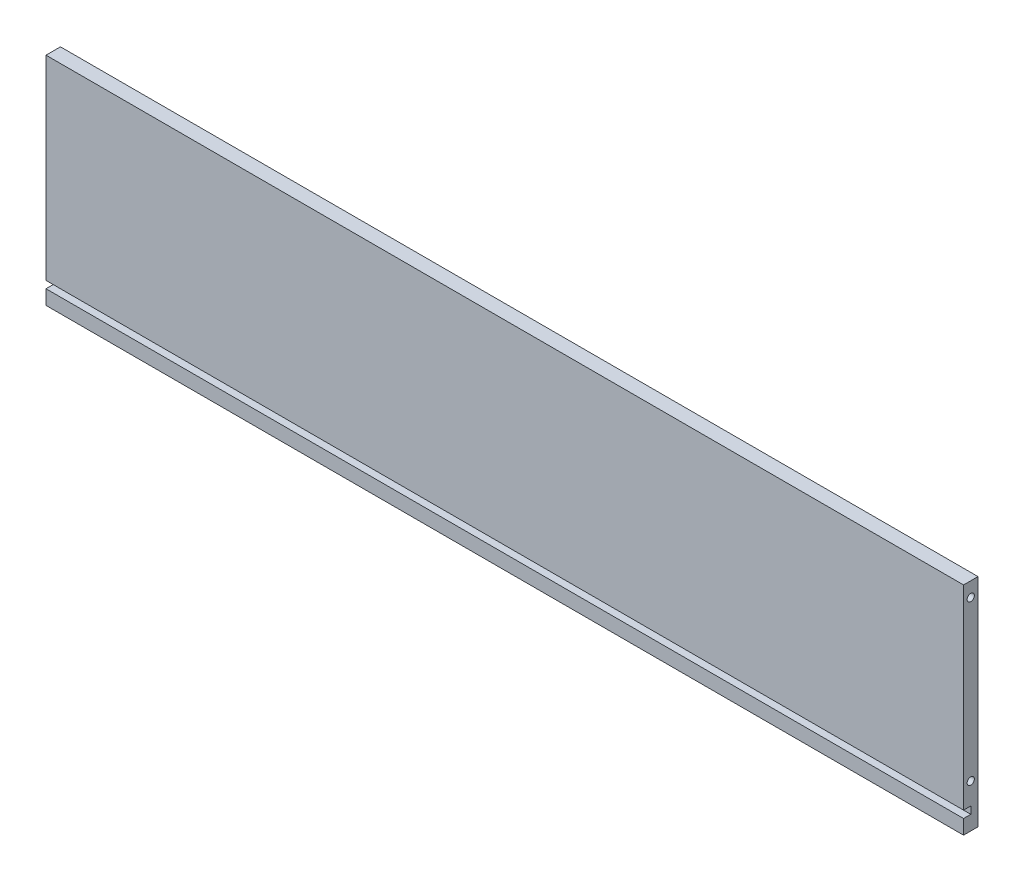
from build123d import *

# Parameters (mm, degrees)
SKETCH1_W                               = 635
SKETCH1_H                               = 150
BASE_EXTRUDE_DEPTH                      = 10
SKETCH2_W                               = 5
SKETCH2_H                               = 5
CUT_EXTRUDE1_DEPTH                      = 641.097648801
M5_0_5_000000_DIAMETER_HOLE1_AT_2_COUNT = 2
M5_0_5_000000_DIAMETER_HOLE1_AT_2_PITCH = 110


with BuildPart() as part:
    # Sketch1 → Base-Extrude (new body)
    with BuildSketch(Plane.XY):
        with Locations((0, 5)):
            Rectangle(SKETCH1_W, SKETCH1_H)
    extrude(amount=BASE_EXTRUDE_DEPTH)

    # Sketch2 → Cut-Extrude1 (cut, through all)
    with BuildSketch(Plane(origin=(317.5, 0, 0), x_dir=(0, 0, -1), z_dir=(1, 0, 0))):
        with Locations((-7.5, -57.5)):
            Rectangle(SKETCH2_W, SKETCH2_H)
    extrude(amount=-CUT_EXTRUDE1_DEPTH, mode=Mode.SUBTRACT)

    # Sketch4 → M5.0 _5.000000_ Diameter Hole1 (revolve, cut)
    with BuildSketch(Plane(origin=(317.5, 70, 5), x_dir=(0, 0, -1), z_dir=(0, 1, 0))):
        Polygon((0, 0), (0, 16.502151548), (2.5, 15), (2.5, 0), align=None)
    m5_0_5_000000_diameter_hole1 = revolve(axis=Axis((323.85, 70, 5), (-1, 0, 0)), mode=Mode.SUBTRACT)

    # M5.0 _5.000000_ Diameter Hole1 at 2: M5.0 _5.000000_ Diameter Hole1 ×2
    with Locations(*[(0, -i * M5_0_5_000000_DIAMETER_HOLE1_AT_2_PITCH, 0) for i in range(1, M5_0_5_000000_DIAMETER_HOLE1_AT_2_COUNT)]):
        add(m5_0_5_000000_diameter_hole1, mode=Mode.SUBTRACT)

    # Mirror1: M5.0 _5.000000_ Diameter Hole1 across plane
    add(m5_0_5_000000_diameter_hole1.mirror(Plane(origin=(0, 0, 0), x_dir=(0, 0, 1), z_dir=(1, 0, 0))), mode=Mode.SUBTRACT)

    # Mirror1 copy 1 sketch → Mirror1 copy 1 (revolve, cut)
    with BuildSketch(Plane(origin=(-317.5, -40, 5), x_dir=(0, 0, -1), z_dir=(0, 1, 0))):
        Polygon((0, 0), (0, -16.502151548), (2.5, -15), (2.5, 0), align=None)
    revolve(axis=Axis((-323.85, -40, 5), (-1, 0, 0)), mode=Mode.SUBTRACT)


solid = part.part
